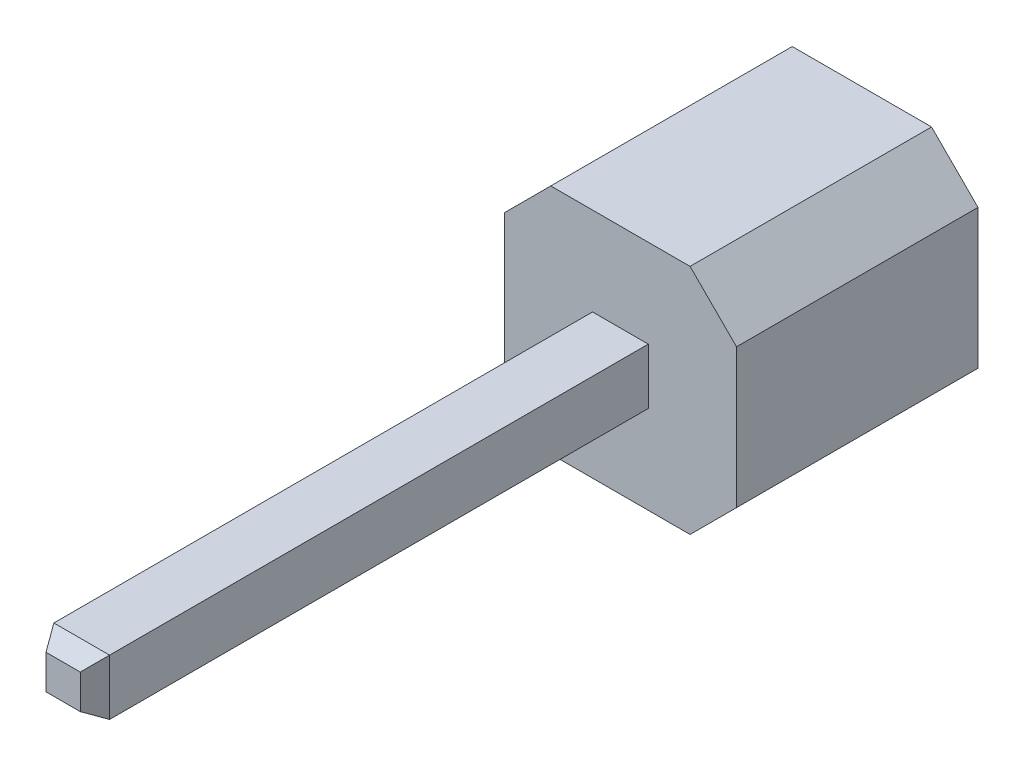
from build123d import *
from OCP.BRepFilletAPI import BRepFilletAPI_MakeChamfer

# Parameters (mm, degrees)
EXTRUDE_1_DEPTH = 2.6
SKETCH_2_W      = 0.6
SKETCH_2_H      = 0.6
EXTRUDE_2_DEPTH = 6
CHAMFER_1_SIZE  = 0.2
CHAMFER_1_SIZE2 = 0.115470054


with BuildPart() as part:
    # Sketch 1 → Extrude 1 (new body)
    with BuildSketch(Plane.XY):
        Polygon((-1.25, 0.75), (-0.75, 1.25), (0.75, 1.25), (1.25, 0.75), (1.25, -0.75), (0.75, -1.25), (-0.75, -1.25), (-1.25, -0.75), align=None)
    extrude(amount=EXTRUDE_1_DEPTH)

    # Sketch 2 → Extrude 2 (add)
    with BuildSketch(Plane.XY.offset(2.6)):
        Rectangle(SKETCH_2_W, SKETCH_2_H)
    extrude(amount=EXTRUDE_2_DEPTH)

    # Chamfer 1: one chamfer whose edges measure the first distance from different faces: ONE call of the kernel's chamfer builder (chamfer() names one face for all edges)
    chamfer_1_edges_1 = [part.edges().sort_by_distance(p)[0] for p in [
        (0.3, 0, 8.6),
    ]]
    chamfer_1_side_1 = [part.faces().sort_by_distance(p)[0] for p in [
        (0.3, 0, 5.6),
    ]]
    chamfer_1_edges_2 = [part.edges().sort_by_distance(p)[0] for p in [
        (0, 0.3, 8.6),
    ]]
    chamfer_1_side_2 = [part.faces().sort_by_distance(p)[0] for p in [
        (0, 0.3, 5.6),
    ]]
    chamfer_1_edges_3 = [part.edges().sort_by_distance(p)[0] for p in [
        (-0.3, 0, 8.6),
    ]]
    chamfer_1_side_3 = [part.faces().sort_by_distance(p)[0] for p in [
        (-0.3, 0, 5.6),
    ]]
    chamfer_1_edges_4 = [part.edges().sort_by_distance(p)[0] for p in [
        (0, -0.3, 8.6),
    ]]
    chamfer_1_side_4 = [part.faces().sort_by_distance(p)[0] for p in [
        (0, -0.3, 5.6),
    ]]
    chamfer_1 = BRepFilletAPI_MakeChamfer(part.part.solid().wrapped)
    for e in chamfer_1_edges_1:
        chamfer_1.Add(CHAMFER_1_SIZE, CHAMFER_1_SIZE2, e.wrapped, chamfer_1_side_1[0].wrapped)  # the first distance lies on this face
    for e in chamfer_1_edges_2:
        chamfer_1.Add(CHAMFER_1_SIZE, CHAMFER_1_SIZE2, e.wrapped, chamfer_1_side_2[0].wrapped)  # the first distance lies on this face
    for e in chamfer_1_edges_3:
        chamfer_1.Add(CHAMFER_1_SIZE, CHAMFER_1_SIZE2, e.wrapped, chamfer_1_side_3[0].wrapped)  # the first distance lies on this face
    for e in chamfer_1_edges_4:
        chamfer_1.Add(CHAMFER_1_SIZE, CHAMFER_1_SIZE2, e.wrapped, chamfer_1_side_4[0].wrapped)  # the first distance lies on this face
    add(Compound.cast(chamfer_1.Shape()), mode=Mode.REPLACE)


solid = part.part
